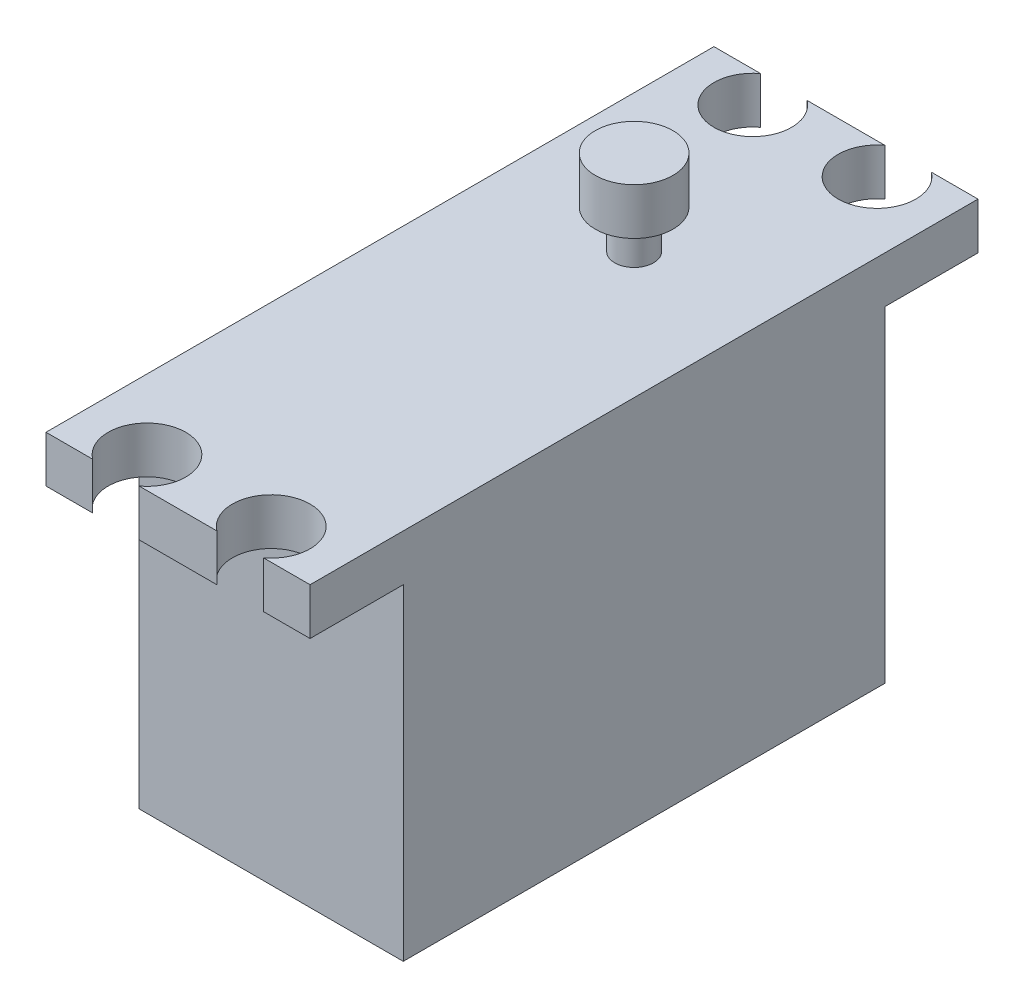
from build123d import *

# Parameters (mm, degrees)
SKETCH1_W           = 17
SKETCH1_H           = 31
BOSS_EXTRUDE1_DEPTH = 21
SKETCH2_W           = 17
SKETCH2_H           = 43
BOSS_EXTRUDE2_DEPTH = 3
SKETCH3_R           = 2.5
CUT_EXTRUDE1_DEPTH  = 3
SKETCH4_R           = 1.25
BOSS_EXTRUDE3_DEPTH = 5.5
SKETCH5_R           = 2.5
BOSS_EXTRUDE4_DEPTH = 3


with BuildPart() as part:
    # Sketch1 → Boss-Extrude1 (new body)
    with BuildSketch(Plane(origin=(0, 0, 0), x_dir=(1, 0, 0), z_dir=(0, 1, 0))):
        with Locations((8.5, -15.5)):
            Rectangle(SKETCH1_W, SKETCH1_H)
    extrude(amount=BOSS_EXTRUDE1_DEPTH)

    # Sketch2 → Boss-Extrude2 (add)
    with BuildSketch(Plane(origin=(0, 21, 0), x_dir=(1, 0, 0), z_dir=(0, 1, 0))):
        with Locations((8.5, -15.5)):
            Rectangle(SKETCH2_W, SKETCH2_H)
    extrude(amount=BOSS_EXTRUDE2_DEPTH)

    # Sketch3 → Cut-Extrude1 (cut)
    with BuildSketch(Plane.XZ.offset(-21)):
        with Locations((4.5, -4)):
            Circle(SKETCH3_R)
        with Locations((12.5, -4)):
            Circle(SKETCH3_R)
        with Locations((12.5, 35)):
            Circle(SKETCH3_R)
        with Locations((4.5, 35)):
            Circle(SKETCH3_R)
    extrude(amount=-CUT_EXTRUDE1_DEPTH, mode=Mode.SUBTRACT)

    # Sketch4 → Boss-Extrude3 (add)
    with BuildSketch(Plane(origin=(0, 24, 0), x_dir=(1, 0, 0), z_dir=(0, 1, 0))):
        with Locations(Location((8.862241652, -8, 0), (0, 0, 270))):
            Circle(SKETCH4_R)
    extrude(amount=BOSS_EXTRUDE3_DEPTH)

    # Sketch5 → Boss-Extrude4 (add)
    with BuildSketch(Plane(origin=(0, 29.5, 0), x_dir=(1, 0, 0), z_dir=(0, 1, 0))):
        with Locations(Location((8.862241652, -8, 0), (0, 0, 270))):
            Circle(SKETCH5_R)
    extrude(amount=-BOSS_EXTRUDE4_DEPTH)


solid = part.part
